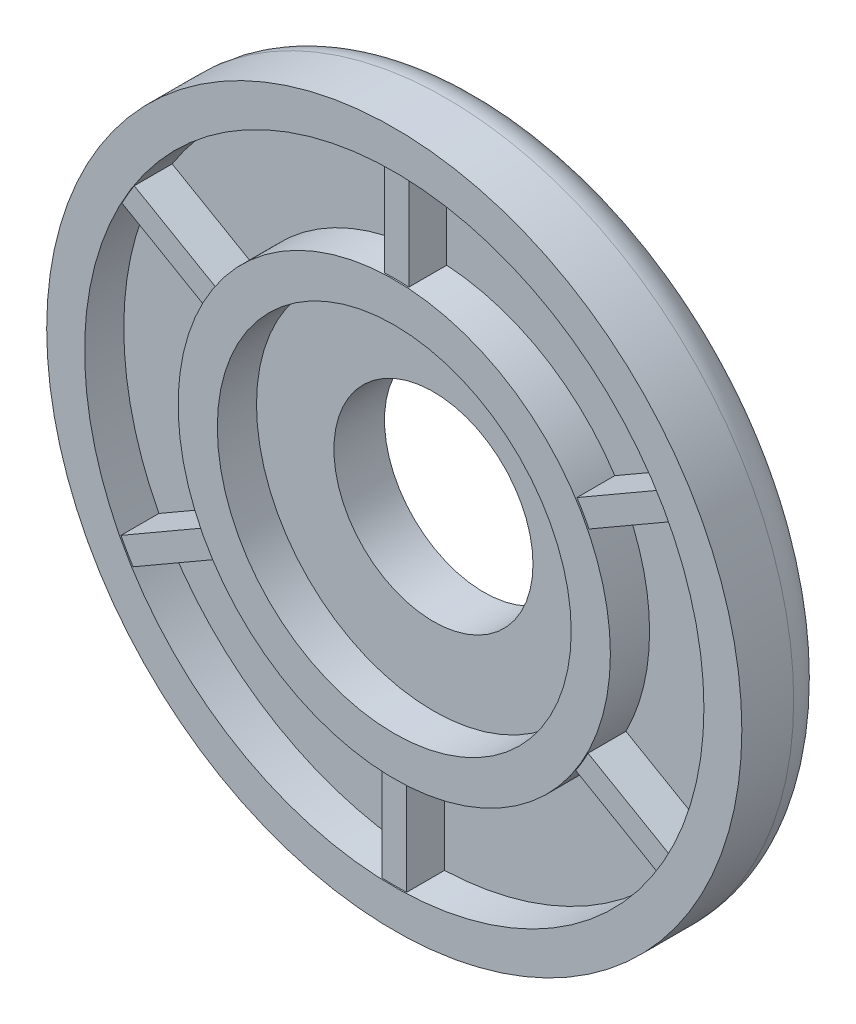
from build123d import *

# Parameters (mm, degrees)
SKETCH_1_R           = 27.5
SKETCH_1_R_2         = 7.875
EXTRUDE_1_DEPTH      = 4
EXTRUDE_2_DEPTH      = 3.1
EXTRUDE_2_DEPTH_BACK = 3.1
SKETCH_2_R           = 27.5
SKETCH_2_R_2         = 24.5
SKETCH_2_R_3         = 17.1
SKETCH_2_R_4         = 14
SKETCH_4_W           = 1.93
SKETCH_4_H           = 8.275236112
EXTRUDE_6_DEPTH      = 3
FILLET_1_R           = 3


with BuildPart() as part:
    # Sketch 1 → Extrude 1 (new body)
    with BuildSketch(Plane.XY):
        Circle(SKETCH_1_R)
        Circle(SKETCH_1_R_2, mode=Mode.SUBTRACT)
    extrude(amount=EXTRUDE_1_DEPTH)

    # Sketch 2 → Extrude 2 (add, two sides: drawn at the far end of the back side and taken through both)
    # profile 1 of 2: a face of its own
    with BuildSketch(Plane.XY.offset(4).offset(-EXTRUDE_2_DEPTH_BACK)):
        Circle(SKETCH_2_R)
        Circle(SKETCH_2_R_2, mode=Mode.SUBTRACT)
    # profile 2 of 2: a face of its own
    with BuildSketch(Plane.XY.offset(4).offset(-EXTRUDE_2_DEPTH_BACK)):
        Circle(SKETCH_2_R_3)
        Circle(SKETCH_2_R_4, mode=Mode.SUBTRACT)
    extrude(amount=EXTRUDE_2_DEPTH + EXTRUDE_2_DEPTH_BACK)

    # Sketch 4 → Extrude 6 (add)
    with BuildSketch(Plane.XY.offset(4)):
        with Locations((0.086458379, 20.793066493)):
            Rectangle(SKETCH_4_W, SKETCH_4_H)
        Polygon((22.116335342, 11.554752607), (21.151335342, 13.226181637), (13.984770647, 9.088563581), (14.949770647, 7.417134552), align=None)
        Polygon((21.064876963, -13.375931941), (22.029876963, -11.704502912), (14.863312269, -7.566884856), (13.898312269, -9.238313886), align=None)
        with Locations((-0.086458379, -20.793066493)):
            Rectangle(SKETCH_4_W, SKETCH_4_H)
        Polygon((-22.116335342, -11.554752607), (-21.151335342, -13.226181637), (-13.984770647, -9.088563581), (-14.949770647, -7.417134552), align=None)
        Polygon((-21.064876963, 13.375931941), (-22.029876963, 11.704502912), (-14.863312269, 7.566884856), (-13.898312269, 9.238313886), align=None)
    extrude(amount=EXTRUDE_6_DEPTH)

    # Fillet 1
    fillet_1_edges = [part.edges().sort_by_distance(p)[0] for p in [
        (-27.5, 0, 0),
    ]]
    fillet(fillet_1_edges, radius=FILLET_1_R)


solid = part.part
